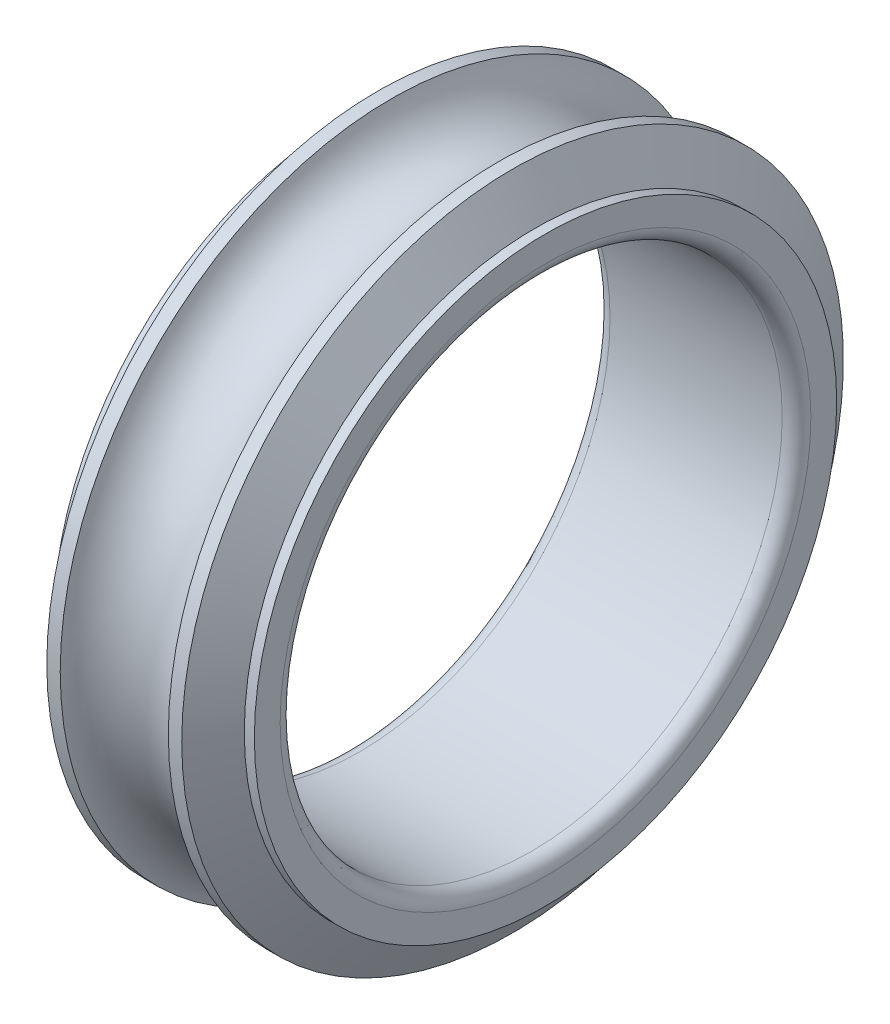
ISO-10303-21;
HEADER;
FILE_DESCRIPTION(('STEP AP214'),'2;1');
FILE_NAME('part.step','',(''),(''),'','','');
FILE_SCHEMA(('AUTOMOTIVE_DESIGN { 1 0 10303 214 1 1 1 1 }'));
ENDSEC;
DATA;
#1=APPLICATION_CONTEXT('core data for automotive mechanical design processes');
#2=APPLICATION_PROTOCOL_DEFINITION('international standard','automotive_design',2000,#1);
#3=PRODUCT_CONTEXT('',#1,'mechanical');
#4=PRODUCT('Part','Part','',(#3));
#5=PRODUCT_RELATED_PRODUCT_CATEGORY('part','',(#4));
#6=PRODUCT_DEFINITION_FORMATION('','',#4);
#7=PRODUCT_DEFINITION_CONTEXT('part definition',#1,'design');
#8=PRODUCT_DEFINITION('design','',#6,#7);
#9=PRODUCT_DEFINITION_SHAPE('','',#8);
#10=(LENGTH_UNIT() NAMED_UNIT(*) SI_UNIT(.MILLI.,.METRE.));
#11=(NAMED_UNIT(*) PLANE_ANGLE_UNIT() SI_UNIT($,.RADIAN.));
#12=(NAMED_UNIT(*) SI_UNIT($,.STERADIAN.) SOLID_ANGLE_UNIT());
#13=UNCERTAINTY_MEASURE_WITH_UNIT(LENGTH_MEASURE(1.E-05),#10,'distance_accuracy_value','');
#14=(GEOMETRIC_REPRESENTATION_CONTEXT(3) GLOBAL_UNCERTAINTY_ASSIGNED_CONTEXT((#13)) GLOBAL_UNIT_ASSIGNED_CONTEXT((#10,
#11,#12)) REPRESENTATION_CONTEXT('',''));
#15=CARTESIAN_POINT('',(0.,0.,0.));
#16=DIRECTION('',(0.,0.,1.));
#17=DIRECTION('',(1.,0.,0.));
#18=AXIS2_PLACEMENT_3D('',#15,#16,#17);
#19=CARTESIAN_POINT('',(13.,0.,0.));
#20=DIRECTION('',(-1.,0.,0.));
#21=DIRECTION('',(0.,0.,1.));
#22=AXIS2_PLACEMENT_3D('',#19,#20,#21);
#23=TOROIDAL_SURFACE('',#22,18.5,1.);
#24=CARTESIAN_POINT('',(14.,0.,0.));
#25=DIRECTION('',(-1.,0.,0.));
#26=DIRECTION('',(0.,0.,1.));
#27=AXIS2_PLACEMENT_3D('',#24,#25,#26);
#28=CIRCLE('',#27,18.5);
#29=CARTESIAN_POINT('',(14.,0.,18.5));
#30=VERTEX_POINT('',#29);
#31=EDGE_CURVE('E10',#30,#30,#28,.T.);
#32=ORIENTED_EDGE('',*,*,#31,.F.);
#33=EDGE_LOOP('',(#32));
#34=FACE_BOUND('',#33,.T.);
#35=CARTESIAN_POINT('',(13.,0.,0.));
#36=DIRECTION('',(-1.,0.,0.));
#37=DIRECTION('',(0.,0.,1.));
#38=AXIS2_PLACEMENT_3D('',#35,#36,#37);
#39=CIRCLE('',#38,17.5);
#40=CARTESIAN_POINT('',(13.,0.,17.5));
#41=VERTEX_POINT('',#40);
#42=EDGE_CURVE('E54',#41,#41,#39,.T.);
#43=ORIENTED_EDGE('',*,*,#42,.T.);
#44=EDGE_LOOP('',(#43));
#45=FACE_BOUND('',#44,.T.);
#46=ADVANCED_FACE('F14',(#34,#45),#23,.T.);
#47=CARTESIAN_POINT('',(14.,18.5,0.));
#48=DIRECTION('',(-1.,0.,0.));
#49=DIRECTION('',(0.,0.,1.));
#50=AXIS2_PLACEMENT_3D('',#47,#48,#49);
#51=PLANE('',#50);
#52=CARTESIAN_POINT('',(14.,0.,0.));
#53=DIRECTION('',(-1.,0.,0.));
#54=DIRECTION('',(0.,0.,1.));
#55=AXIS2_PLACEMENT_3D('',#52,#53,#54);
#56=CIRCLE('',#55,20.3000001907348);
#57=CARTESIAN_POINT('',(14.,0.,20.3000001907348));
#58=VERTEX_POINT('',#57);
#59=EDGE_CURVE('E20',#58,#58,#56,.T.);
#60=ORIENTED_EDGE('',*,*,#59,.F.);
#61=EDGE_LOOP('',(#60));
#62=FACE_BOUND('',#61,.T.);
#63=ORIENTED_EDGE('',*,*,#31,.T.);
#64=EDGE_LOOP('',(#63));
#65=FACE_BOUND('',#64,.T.);
#66=ADVANCED_FACE('F108',(#62,#65),#51,.F.);
#67=CARTESIAN_POINT('',(0.,0.,0.));
#68=DIRECTION('',(-1.,0.,0.));
#69=DIRECTION('',(0.,0.,1.));
#70=AXIS2_PLACEMENT_3D('',#67,#68,#69);
#71=CYLINDRICAL_SURFACE('',#70,20.3000001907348);
#72=CARTESIAN_POINT('',(13.3,0.,0.));
#73=DIRECTION('',(-1.,0.,0.));
#74=DIRECTION('',(0.,0.,1.));
#75=AXIS2_PLACEMENT_3D('',#72,#73,#74);
#76=CIRCLE('',#75,20.3000001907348);
#77=CARTESIAN_POINT('',(13.3,0.,20.3000001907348));
#78=VERTEX_POINT('',#77);
#79=EDGE_CURVE('E24',#78,#78,#76,.T.);
#80=ORIENTED_EDGE('',*,*,#79,.F.);
#81=EDGE_LOOP('',(#80));
#82=FACE_BOUND('',#81,.T.);
#83=ORIENTED_EDGE('',*,*,#59,.T.);
#84=EDGE_LOOP('',(#83));
#85=FACE_BOUND('',#84,.T.);
#86=ADVANCED_FACE('F114',(#82,#85),#71,.T.);
#87=CARTESIAN_POINT('',(13.3,0.,0.));
#88=DIRECTION('',(-1.,0.,0.));
#89=DIRECTION('',(0.,0.,1.));
#90=AXIS2_PLACEMENT_3D('',#87,#88,#89);
#91=CONICAL_SURFACE('',#90,20.3000001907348,1.0471975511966);
#92=CARTESIAN_POINT('',(11.7036266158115,0.,0.));
#93=DIRECTION('',(-1.,0.,0.));
#94=DIRECTION('',(0.,0.,1.));
#95=AXIS2_PLACEMENT_3D('',#92,#93,#94);
#96=CIRCLE('',#95,23.065);
#97=CARTESIAN_POINT('',(11.7036266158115,0.,23.065));
#98=VERTEX_POINT('',#97);
#99=EDGE_CURVE('E28',#98,#98,#96,.T.);
#100=ORIENTED_EDGE('',*,*,#99,.F.);
#101=EDGE_LOOP('',(#100));
#102=FACE_BOUND('',#101,.T.);
#103=ORIENTED_EDGE('',*,*,#79,.T.);
#104=EDGE_LOOP('',(#103));
#105=FACE_BOUND('',#104,.T.);
#106=ADVANCED_FACE('F104',(#102,#105),#91,.T.);
#107=CARTESIAN_POINT('',(0.,0.,0.));
#108=DIRECTION('',(-1.,0.,0.));
#109=DIRECTION('',(0.,0.,1.));
#110=AXIS2_PLACEMENT_3D('',#107,#108,#109);
#111=CYLINDRICAL_SURFACE('',#110,23.065);
#112=CARTESIAN_POINT('',(10.7680598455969,0.,0.));
#113=DIRECTION('',(-1.,0.,0.));
#114=DIRECTION('',(0.,0.,1.));
#115=AXIS2_PLACEMENT_3D('',#112,#113,#114);
#116=CIRCLE('',#115,23.065);
#117=CARTESIAN_POINT('',(10.7680598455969,0.,23.065));
#118=VERTEX_POINT('',#117);
#119=EDGE_CURVE('E33',#118,#118,#116,.T.);
#120=ORIENTED_EDGE('',*,*,#119,.F.);
#121=EDGE_LOOP('',(#120));
#122=FACE_BOUND('',#121,.T.);
#123=ORIENTED_EDGE('',*,*,#99,.T.);
#124=EDGE_LOOP('',(#123));
#125=FACE_BOUND('',#124,.T.);
#126=ADVANCED_FACE('F97',(#122,#125),#111,.T.);
#127=CARTESIAN_POINT('',(7.,0.,0.));
#128=DIRECTION('',(-1.,0.,0.));
#129=DIRECTION('',(0.,0.,1.));
#130=AXIS2_PLACEMENT_3D('',#127,#128,#129);
#131=TOROIDAL_SURFACE('',#130,24.25,3.95);
#132=ORIENTED_EDGE('',*,*,#119,.T.);
#133=EDGE_LOOP('',(#132));
#134=FACE_BOUND('',#133,.T.);
#135=CARTESIAN_POINT('',(3.23194015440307,0.,0.));
#136=DIRECTION('',(-1.,0.,0.));
#137=DIRECTION('',(0.,0.,1.));
#138=AXIS2_PLACEMENT_3D('',#135,#136,#137);
#139=CIRCLE('',#138,23.065);
#140=CARTESIAN_POINT('',(3.23194015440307,0.,23.065));
#141=VERTEX_POINT('',#140);
#142=EDGE_CURVE('E36',#141,#141,#139,.T.);
#143=ORIENTED_EDGE('',*,*,#142,.F.);
#144=EDGE_LOOP('',(#143));
#145=FACE_BOUND('',#144,.T.);
#146=ADVANCED_FACE('F92',(#134,#145),#131,.F.);
#147=CARTESIAN_POINT('',(0.,0.,0.));
#148=DIRECTION('',(-1.,0.,0.));
#149=DIRECTION('',(0.,0.,1.));
#150=AXIS2_PLACEMENT_3D('',#147,#148,#149);
#151=CYLINDRICAL_SURFACE('',#150,23.065);
#152=CARTESIAN_POINT('',(2.2963733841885,0.,0.));
#153=DIRECTION('',(-1.,0.,0.));
#154=DIRECTION('',(0.,0.,1.));
#155=AXIS2_PLACEMENT_3D('',#152,#153,#154);
#156=CIRCLE('',#155,23.065);
#157=CARTESIAN_POINT('',(2.2963733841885,0.,23.065));
#158=VERTEX_POINT('',#157);
#159=EDGE_CURVE('E39',#158,#158,#156,.T.);
#160=ORIENTED_EDGE('',*,*,#159,.F.);
#161=EDGE_LOOP('',(#160));
#162=FACE_BOUND('',#161,.T.);
#163=ORIENTED_EDGE('',*,*,#142,.T.);
#164=EDGE_LOOP('',(#163));
#165=FACE_BOUND('',#164,.T.);
#166=ADVANCED_FACE('F86',(#162,#165),#151,.T.);
#167=CARTESIAN_POINT('',(2.2963733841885,0.,0.));
#168=DIRECTION('',(1.,0.,0.));
#169=DIRECTION('',(0.,0.,-1.));
#170=AXIS2_PLACEMENT_3D('',#167,#168,#169);
#171=CONICAL_SURFACE('',#170,23.065,1.0471975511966);
#172=CARTESIAN_POINT('',(0.7,0.,0.));
#173=DIRECTION('',(-1.,0.,0.));
#174=DIRECTION('',(0.,0.,1.));
#175=AXIS2_PLACEMENT_3D('',#172,#173,#174);
#176=CIRCLE('',#175,20.3000001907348);
#177=CARTESIAN_POINT('',(0.7,0.,20.3000001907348));
#178=VERTEX_POINT('',#177);
#179=EDGE_CURVE('E42',#178,#178,#176,.T.);
#180=ORIENTED_EDGE('',*,*,#179,.F.);
#181=EDGE_LOOP('',(#180));
#182=FACE_BOUND('',#181,.T.);
#183=ORIENTED_EDGE('',*,*,#159,.T.);
#184=EDGE_LOOP('',(#183));
#185=FACE_BOUND('',#184,.T.);
#186=ADVANCED_FACE('F80',(#182,#185),#171,.T.);
#187=CARTESIAN_POINT('',(0.,0.,0.));
#188=DIRECTION('',(-1.,0.,0.));
#189=DIRECTION('',(0.,0.,1.));
#190=AXIS2_PLACEMENT_3D('',#187,#188,#189);
#191=CYLINDRICAL_SURFACE('',#190,20.3000001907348);
#192=CARTESIAN_POINT('',(0.,0.,0.));
#193=DIRECTION('',(-1.,0.,0.));
#194=DIRECTION('',(0.,0.,1.));
#195=AXIS2_PLACEMENT_3D('',#192,#193,#194);
#196=CIRCLE('',#195,20.3000001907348);
#197=CARTESIAN_POINT('',(0.,0.,20.3000001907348));
#198=VERTEX_POINT('',#197);
#199=EDGE_CURVE('E45',#198,#198,#196,.T.);
#200=ORIENTED_EDGE('',*,*,#199,.F.);
#201=EDGE_LOOP('',(#200));
#202=FACE_BOUND('',#201,.T.);
#203=ORIENTED_EDGE('',*,*,#179,.T.);
#204=EDGE_LOOP('',(#203));
#205=FACE_BOUND('',#204,.T.);
#206=ADVANCED_FACE('F74',(#202,#205),#191,.T.);
#207=CARTESIAN_POINT('',(0.,20.3000001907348,0.));
#208=DIRECTION('',(1.,0.,0.));
#209=DIRECTION('',(0.,0.,-1.));
#210=AXIS2_PLACEMENT_3D('',#207,#208,#209);
#211=PLANE('',#210);
#212=CARTESIAN_POINT('',(0.,0.,0.));
#213=DIRECTION('',(-1.,0.,0.));
#214=DIRECTION('',(0.,0.,1.));
#215=AXIS2_PLACEMENT_3D('',#212,#213,#214);
#216=CIRCLE('',#215,18.5);
#217=CARTESIAN_POINT('',(0.,0.,18.5));
#218=VERTEX_POINT('',#217);
#219=EDGE_CURVE('E48',#218,#218,#216,.T.);
#220=ORIENTED_EDGE('',*,*,#219,.F.);
#221=EDGE_LOOP('',(#220));
#222=FACE_BOUND('',#221,.T.);
#223=ORIENTED_EDGE('',*,*,#199,.T.);
#224=EDGE_LOOP('',(#223));
#225=FACE_BOUND('',#224,.T.);
#226=ADVANCED_FACE('F68',(#222,#225),#211,.F.);
#227=CARTESIAN_POINT('',(1.,0.,0.));
#228=DIRECTION('',(-1.,0.,0.));
#229=DIRECTION('',(0.,0.,1.));
#230=AXIS2_PLACEMENT_3D('',#227,#228,#229);
#231=TOROIDAL_SURFACE('',#230,18.5,1.);
#232=CARTESIAN_POINT('',(1.,0.,0.));
#233=DIRECTION('',(-1.,0.,0.));
#234=DIRECTION('',(0.,0.,1.));
#235=AXIS2_PLACEMENT_3D('',#232,#233,#234);
#236=CIRCLE('',#235,17.5);
#237=CARTESIAN_POINT('',(1.,0.,17.5));
#238=VERTEX_POINT('',#237);
#239=EDGE_CURVE('E51',#238,#238,#236,.T.);
#240=ORIENTED_EDGE('',*,*,#239,.F.);
#241=EDGE_LOOP('',(#240));
#242=FACE_BOUND('',#241,.T.);
#243=ORIENTED_EDGE('',*,*,#219,.T.);
#244=EDGE_LOOP('',(#243));
#245=FACE_BOUND('',#244,.T.);
#246=ADVANCED_FACE('F62',(#242,#245),#231,.T.);
#247=CARTESIAN_POINT('',(0.,0.,0.));
#248=DIRECTION('',(-1.,0.,0.));
#249=DIRECTION('',(0.,0.,1.));
#250=AXIS2_PLACEMENT_3D('',#247,#248,#249);
#251=CYLINDRICAL_SURFACE('',#250,17.5);
#252=ORIENTED_EDGE('',*,*,#42,.F.);
#253=EDGE_LOOP('',(#252));
#254=FACE_BOUND('',#253,.T.);
#255=ORIENTED_EDGE('',*,*,#239,.T.);
#256=EDGE_LOOP('',(#255));
#257=FACE_BOUND('',#256,.T.);
#258=ADVANCED_FACE('F59',(#254,#257),#251,.F.);
#259=CLOSED_SHELL('',(#46,#66,#86,#106,#126,#146,#166,#186,#206,#226,#246,#258));
#260=MANIFOLD_SOLID_BREP('B1',#259);
#261=ADVANCED_BREP_SHAPE_REPRESENTATION('',(#18,#260),#14);
#262=SHAPE_DEFINITION_REPRESENTATION(#9,#261);
ENDSEC;
END-ISO-10303-21;
